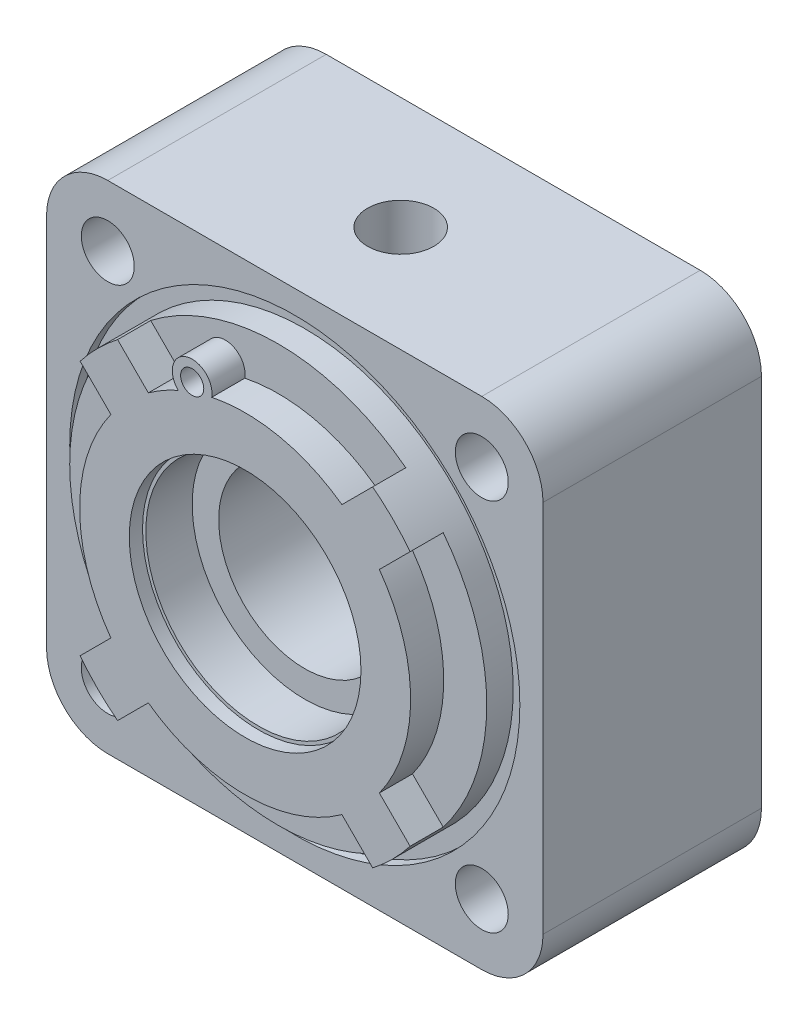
from build123d import *
from build123d.topology import SkipClean

# Parameters (mm, degrees)
BASE_EXTRUSION_DEPTH      = 1
BASE_EXTRUSION_DEPTH_BACK = 32
ESQUISSE1_W               = 75
ESQUISSE1_H               = 75
ESQUISSE2_R               = 20
BOSS_EXTRU_1_DEPTH        = 4
ESQUISSE3_R               = 6.5
ENL_V_MAT_EXTRU_1_DEPTH   = 31
ESQUISSE4_R               = 4
ENL_V_MAT_EXTRU_2_DEPTH   = 66.450806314
ESQUISSE7_R               = 34
ENL_V_MAT_EXTRU_3_DEPTH   = 1.5
ESQUISSE8_R               = 31.5
BOSS_EXTRU_2_DEPTH        = 4
ESQUISSE9_R               = 17
BOSS_EXTRU_3_DEPTH        = 5
ESQUISSE10_R              = 13
ENL_V_MAT_EXTRU_4_DEPTH   = 35.5
ENL_V_START               = -6
ESQUISSE12_R              = 20
ENL_V_MAT_EXTRU_7_DEPTH   = 6
ESQUISSE21_R              = 1.75
ENL_V_MAT_EXTRU_13_DEPTH  = 20
ESQUISSE22_R              = 17.5
ENL_V_MAT_EXTRU_14_DEPTH  = 2
ENL_V_START_2             = -4
ESQUISSE23_R              = 17
ENL_V_MAT_EXTRU_15_DEPTH  = 4
CONG_1_R                  = 9.25
ESQUISSE24_R              = 5
ENL_V_MAT_EXTRU_16_DEPTH  = 25


with BuildPart() as part:
    # Esquisse1 → Base-Extrusion (new, two sides: drawn at the far end of the back side and taken through both)
    with BuildSketch(Plane.XY.offset(-BASE_EXTRUSION_DEPTH_BACK)):
        Rectangle(ESQUISSE1_W, ESQUISSE1_H)
    extrude(amount=BASE_EXTRUSION_DEPTH + BASE_EXTRUSION_DEPTH_BACK)

    # Esquisse2 → Boss.-Extru.1 (add)
    with BuildSketch(Plane(origin=(0, 0, -32), x_dir=(-1, 0, 0), z_dir=(0, 0, -1))):
        Circle(ESQUISSE2_R)
    extrude(amount=BOSS_EXTRU_1_DEPTH)

    # Esquisse3 → Enl_v. mat.-Extru.1 (cut)
    with BuildSketch(Plane(origin=(-0.323821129, 5.504958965, -36), x_dir=(-1, 0, 0), z_dir=(0, 0, -1))):
        with Locations((-28.573821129, 22.745041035)):
            Circle(ESQUISSE3_R)
        with Locations((27.926178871, 22.745041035)):
            Circle(ESQUISSE3_R)
        with Locations((27.926178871, -33.754958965)):
            Circle(ESQUISSE3_R)
        with Locations(Location((-28.573821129, -33.754958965, 0), (0, 0, 180))):
            Circle(ESQUISSE3_R)
    extrude(amount=-ENL_V_MAT_EXTRU_1_DEPTH, mode=Mode.SUBTRACT)

    # Esquisse4 → Enl_v. mat.-Extru.2 (cut, through all)
    with BuildSketch(Plane(origin=(-0.675961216, -0.675961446, -36), x_dir=(-1, 0, 0), z_dir=(0, 0, -1))):
        with Locations((-28.925961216, 28.925961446)):
            Circle(ESQUISSE4_R)
        with Locations((27.574038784, 28.925961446)):
            Circle(ESQUISSE4_R)
        with Locations((27.574038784, -27.574038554)):
            Circle(ESQUISSE4_R)
        with Locations(Location((-28.925961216, -27.574038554, 0), (0, 0, 180))):
            Circle(ESQUISSE4_R)
    extrude(amount=-ENL_V_MAT_EXTRU_2_DEPTH, mode=Mode.SUBTRACT)

    # Esquisse7 → Enl_v. mat.-Extru.3 (cut)
    with BuildSketch(Plane.XY.offset(1)):
        Circle(ESQUISSE7_R)
    extrude(amount=-ENL_V_MAT_EXTRU_3_DEPTH, mode=Mode.SUBTRACT)

    # Esquisse8 → Boss.-Extru.2 (add)
    with BuildSketch(Plane.XY.offset(-0.5)):
        with Locations(Location((0, 0, 0), (0, 0, 142.295351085))):
            Circle(ESQUISSE8_R)
    extrude(amount=BOSS_EXTRU_2_DEPTH)

    # Esquisse9 → Boss.-Extru.3 (add)
    with SkipClean():  # the faces are left unmerged after this step: merging them gives an invalid solid
        with BuildSketch(Plane.XY.offset(3.5)):
            with BuildLine():
                Line((-14.621501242, -20.278355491), (-19.265123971, -24.92197822))
                ThreePointArc((-19.265123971, -24.92197822), (-22.273863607, -22.273863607), (-24.92197822, -19.265123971))
                Line((-24.92197822, -19.265123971), (-20.278355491, -14.621501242))
                ThreePointArc((-20.278355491, -14.621501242), (-25, 0), (-20.278355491, 14.621501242))
                Line((-20.278355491, 14.621501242), (-24.92197822, 19.265123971))
                ThreePointArc((-24.92197822, 19.265123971), (-22.273863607, 22.273863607), (-19.265123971, 24.92197822))
                Line((-19.265123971, 24.92197822), (-14.621501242, 20.278355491))
                ThreePointArc((-14.621501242, 20.278355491), (-12.432227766, 21.689622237), (-10.107998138, 22.865440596))
                ThreePointArc((-10.107998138, 22.865440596), (-8.914327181, 27.857272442), (-5.044396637, 24.485793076))
                ThreePointArc((-5.044396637, 24.485793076), (-2.535268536, 24.871116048), (0, 25))
                ThreePointArc((0, 25), (7.682483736, 23.790322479), (14.621501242, 20.278355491))
                Line((14.621501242, 20.278355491), (19.265123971, 24.92197822))
                ThreePointArc((19.265123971, 24.92197822), (22.273863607, 22.273863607), (24.92197822, 19.265123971))
                Line((24.92197822, 19.265123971), (20.278355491, 14.621501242))
                ThreePointArc((20.278355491, 14.621501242), (25, 0), (20.278355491, -14.621501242))
                Line((20.278355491, -14.621501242), (24.92197822, -19.265123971))
                ThreePointArc((24.92197822, -19.265123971), (22.273863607, -22.273863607), (19.265123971, -24.92197822))
                Line((19.265123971, -24.92197822), (14.621501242, -20.278355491))
                ThreePointArc((14.621501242, -20.278355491), (0, -25), (-14.621501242, -20.278355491))
            make_face()
            Circle(ESQUISSE9_R, mode=Mode.SUBTRACT)
        extrude(amount=BOSS_EXTRU_3_DEPTH)

    # Esquisse10 → Enl_v. mat.-Extru.4 (cut)
    with SkipClean():  # the faces are left unmerged after this step: merging them gives an invalid solid
        with BuildSketch(Plane.XY.offset(3.5)):
            Circle(ESQUISSE10_R)
        extrude(amount=-ENL_V_MAT_EXTRU_4_DEPTH, mode=Mode.SUBTRACT)

    # Esquisse12 → Enl_v. mat.-Extru.7 (cut)
    with SkipClean():  # the faces are left unmerged after this step: merging them gives an invalid solid
        with BuildSketch(Plane(origin=(-0.135192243, -0.135192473, -36), x_dir=(-1, 0, 0), z_dir=(0, 0, -1)).offset(ENL_V_START)):
            with BuildLine():
                Line((14.864807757, 24.635192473), (14.864807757, 28.135192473))
                ThreePointArc((14.864807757, 28.135192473), (14.279021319, 29.549406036), (12.864807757, 30.135192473))
                Line((12.864807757, 30.135192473), (-13.135192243, 30.135192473))
                ThreePointArc((-13.135192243, 30.135192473), (-14.549405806, 29.549406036), (-15.135192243, 28.135192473))
                Line((-15.135192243, 28.135192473), (-15.135192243, 24.635192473))
                ThreePointArc((-15.135192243, 24.635192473), (-17.917677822, 17.917678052), (-24.635192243, 15.135192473))
                Line((-24.635192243, 15.135192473), (-28.135192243, 15.135192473))
                ThreePointArc((-28.135192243, 15.135192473), (-29.549405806, 14.549406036), (-30.135192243, 13.135192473))
                Line((-30.135192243, 13.135192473), (-30.135192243, -12.864807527))
                ThreePointArc((-30.135192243, -12.864807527), (-29.549405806, -14.279021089), (-28.135192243, -14.864807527))
                Line((-28.135192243, -14.864807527), (-24.635192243, -14.864807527))
                ThreePointArc((-24.635192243, -14.864807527), (-17.917677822, -17.647293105), (-15.135192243, -24.364807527))
                Line((-15.135192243, -24.364807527), (-15.135192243, -27.864807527))
                ThreePointArc((-15.135192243, -27.864807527), (-14.549405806, -29.279021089), (-13.135192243, -29.864807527))
                Line((-13.135192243, -29.864807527), (12.864807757, -29.864807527))
                ThreePointArc((12.864807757, -29.864807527), (14.279021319, -29.279021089), (14.864807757, -27.864807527))
                Line((14.864807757, -27.864807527), (14.864807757, -24.364807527))
                ThreePointArc((14.864807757, -24.364807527), (17.647293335, -17.647293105), (24.364807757, -14.864807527))
                Line((24.364807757, -14.864807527), (27.864807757, -14.864807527))
                ThreePointArc((27.864807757, -14.864807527), (29.279021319, -14.279021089), (29.864807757, -12.864807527))
                Line((29.864807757, -12.864807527), (29.864807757, 13.135192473))
                ThreePointArc((29.864807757, 13.135192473), (29.279021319, 14.549406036), (27.864807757, 15.135192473))
                Line((27.864807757, 15.135192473), (24.364807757, 15.135192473))
                ThreePointArc((24.364807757, 15.135192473), (17.647293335, 17.917678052), (14.864807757, 24.635192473))
            make_face()
            with Locations((-0.135192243, 0.135192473)):
                Circle(ESQUISSE12_R, mode=Mode.SUBTRACT)
        extrude(amount=ENL_V_MAT_EXTRU_7_DEPTH, mode=Mode.SUBTRACT)

    # Esquisse21 → Enl_v. mat.-Extru.13 (cut)
    with SkipClean():  # the faces are left unmerged after this step: merging them gives an invalid solid
        with BuildSketch(Plane.XY.offset(8.5)):
            with Locations((-8, 25)):
                Circle(ESQUISSE21_R)
        extrude(amount=-ENL_V_MAT_EXTRU_13_DEPTH, mode=Mode.SUBTRACT)

    # Esquisse22 → Enl_v. mat.-Extru.14 (cut)
    with SkipClean():  # the faces are left unmerged after this step: merging them gives an invalid solid
        with BuildSketch(Plane.XY.offset(8.5)):
            Circle(ESQUISSE22_R)
        extrude(amount=-ENL_V_MAT_EXTRU_14_DEPTH, mode=Mode.SUBTRACT)

    # Esquisse23 → Enl_v. mat.-Extru.15 (cut)
    with SkipClean():  # the faces are left unmerged after this step: merging them gives an invalid solid
        with BuildSketch(Plane.XY.offset(3.5).offset(ENL_V_START_2)):
            Circle(ESQUISSE23_R)
        extrude(amount=ENL_V_MAT_EXTRU_15_DEPTH, mode=Mode.SUBTRACT)

    # Cong_1
    cong_1_edges = [part.edges().sort_by_distance(p)[0] for p in [
        (37.5, 37.5, -15.5),
        (-37.5, 37.5, -15.5),
        (37.5, -37.5, -15.5),
        (-37.5, -37.5, -15.5),
    ]]
    fillet(cong_1_edges, radius=CONG_1_R)

    # Esquisse24 → Enl_v. mat.-Extru.16 (cut, symmetric)
    with SkipClean():  # the faces are left unmerged after this step: merging them gives an invalid solid
        with BuildSketch(Plane(origin=(0, 37.5, 0), x_dir=(-1, 0, 0), z_dir=(0, 1, 0))):
            with Locations(Location((0, -15, 0), (0, 0, 90))):
                Circle(ESQUISSE24_R)
        extrude(amount=ENL_V_MAT_EXTRU_16_DEPTH, both=True, mode=Mode.SUBTRACT)


solid = part.part
